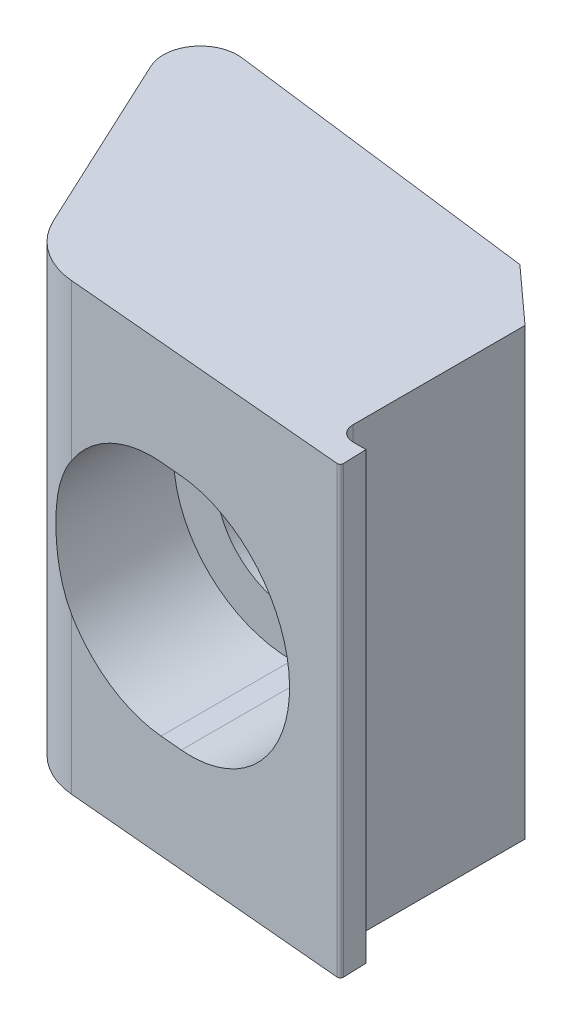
ISO-10303-21;
HEADER;
FILE_DESCRIPTION(('STEP AP214'),'2;1');
FILE_NAME('part.step','',(''),(''),'','','');
FILE_SCHEMA(('AUTOMOTIVE_DESIGN { 1 0 10303 214 1 1 1 1 }'));
ENDSEC;
DATA;
#1=APPLICATION_CONTEXT('core data for automotive mechanical design processes');
#2=APPLICATION_PROTOCOL_DEFINITION('international standard','automotive_design',2000,#1);
#3=PRODUCT_CONTEXT('',#1,'mechanical');
#4=PRODUCT('Part','Part','',(#3));
#5=PRODUCT_RELATED_PRODUCT_CATEGORY('part','',(#4));
#6=PRODUCT_DEFINITION_FORMATION('','',#4);
#7=PRODUCT_DEFINITION_CONTEXT('part definition',#1,'design');
#8=PRODUCT_DEFINITION('design','',#6,#7);
#9=PRODUCT_DEFINITION_SHAPE('','',#8);
#10=(LENGTH_UNIT() NAMED_UNIT(*) SI_UNIT(.MILLI.,.METRE.));
#11=(NAMED_UNIT(*) PLANE_ANGLE_UNIT() SI_UNIT($,.RADIAN.));
#12=(NAMED_UNIT(*) SI_UNIT($,.STERADIAN.) SOLID_ANGLE_UNIT());
#13=UNCERTAINTY_MEASURE_WITH_UNIT(LENGTH_MEASURE(1.E-05),#10,'distance_accuracy_value','');
#14=(GEOMETRIC_REPRESENTATION_CONTEXT(3) GLOBAL_UNCERTAINTY_ASSIGNED_CONTEXT((#13)) GLOBAL_UNIT_ASSIGNED_CONTEXT((#10,
#11,#12)) REPRESENTATION_CONTEXT('',''));
#15=CARTESIAN_POINT('',(0.,0.,0.));
#16=DIRECTION('',(0.,0.,1.));
#17=DIRECTION('',(1.,0.,0.));
#18=AXIS2_PLACEMENT_3D('',#15,#16,#17);
#19=CARTESIAN_POINT('',(7.6938110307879,19.05,3.45326209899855));
#20=DIRECTION('',(-0.671723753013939,0.,0.740801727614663));
#21=DIRECTION('',(0.740801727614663,0.,0.671723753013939));
#22=AXIS2_PLACEMENT_3D('',#19,#20,#21);
#23=PLANE('',#22);
#24=DIRECTION('',(-0.740801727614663,0.,-0.671723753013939));
#25=VECTOR('',#24,1.);
#26=CARTESIAN_POINT('',(7.6938110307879,-19.05,3.45326209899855));
#27=LINE('',#26,#25);
#28=CARTESIAN_POINT('',(12.4334510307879,-19.05,7.75094209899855));
#29=VERTEX_POINT('',#28);
#30=CARTESIAN_POINT('',(7.6938110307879,-19.05,3.45326209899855));
#31=VERTEX_POINT('',#30);
#32=EDGE_CURVE('E221',#29,#31,#27,.T.);
#33=ORIENTED_EDGE('',*,*,#32,.T.);
#34=DIRECTION('',(0.,-1.,0.));
#35=VECTOR('',#34,1.);
#36=CARTESIAN_POINT('',(7.6938110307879,19.05,3.45326209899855));
#37=LINE('',#36,#35);
#38=CARTESIAN_POINT('',(7.6938110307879,19.05,3.45326209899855));
#39=VERTEX_POINT('',#38);
#40=EDGE_CURVE('E296',#39,#31,#37,.T.);
#41=ORIENTED_EDGE('',*,*,#40,.F.);
#42=DIRECTION('',(-0.740801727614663,0.,-0.671723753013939));
#43=VECTOR('',#42,1.);
#44=CARTESIAN_POINT('',(7.6938110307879,19.05,3.45326209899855));
#45=LINE('',#44,#43);
#46=CARTESIAN_POINT('',(12.4334510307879,19.05,7.75094209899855));
#47=VERTEX_POINT('',#46);
#48=EDGE_CURVE('E324',#47,#39,#45,.T.);
#49=ORIENTED_EDGE('',*,*,#48,.F.);
#50=DIRECTION('',(0.,-1.,0.));
#51=VECTOR('',#50,1.);
#52=CARTESIAN_POINT('',(12.4334510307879,19.05,7.75094209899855));
#53=LINE('',#52,#51);
#54=EDGE_CURVE('E298',#47,#29,#53,.T.);
#55=ORIENTED_EDGE('',*,*,#54,.T.);
#56=EDGE_LOOP('',(#33,#41,#49,#55));
#57=FACE_BOUND('',#56,.T.);
#58=ADVANCED_FACE('F14',(#57),#23,.F.);
#59=CARTESIAN_POINT('',(-19.5552004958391,19.05,0.0248360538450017));
#60=DIRECTION('',(-0.124834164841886,0.,0.992177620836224));
#61=DIRECTION('',(0.992177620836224,0.,0.124834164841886));
#62=AXIS2_PLACEMENT_3D('',#59,#60,#61);
#63=PLANE('',#62);
#64=DIRECTION('',(0.992177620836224,0.,0.124834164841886));
#65=VECTOR('',#64,1.);
#66=CARTESIAN_POINT('',(-19.5552004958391,-6.5405,0.0248360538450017));
#67=LINE('',#66,#65);
#68=CARTESIAN_POINT('',(-1.905,-6.5405,2.245555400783));
#69=VERTEX_POINT('',#68);
#70=CARTESIAN_POINT('',(0.,-6.5405,2.48523938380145));
#71=VERTEX_POINT('',#70);
#72=EDGE_CURVE('E183',#69,#71,#67,.T.);
#73=ORIENTED_EDGE('',*,*,#72,.T.);
#74=CARTESIAN_POINT('',(0.,0.,2.48523938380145));
#75=DIRECTION('',(-0.124834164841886,0.,0.992177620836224));
#76=DIRECTION('',(0.992177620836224,0.,0.124834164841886));
#77=AXIS2_PLACEMENT_3D('',#74,#75,#76);
#78=ELLIPSE('',#77,6.59206563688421,6.5405);
#79=CARTESIAN_POINT('',(0.,6.5405,2.48523938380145));
#80=VERTEX_POINT('',#79);
#81=EDGE_CURVE('E186',#71,#80,#78,.T.);
#82=ORIENTED_EDGE('',*,*,#81,.T.);
#83=DIRECTION('',(-0.992177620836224,0.,-0.124834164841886));
#84=VECTOR('',#83,1.);
#85=CARTESIAN_POINT('',(-19.5552004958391,6.5405,0.0248360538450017));
#86=LINE('',#85,#84);
#87=CARTESIAN_POINT('',(-1.905,6.5405,2.245555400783));
#88=VERTEX_POINT('',#87);
#89=EDGE_CURVE('E178',#80,#88,#86,.T.);
#90=ORIENTED_EDGE('',*,*,#89,.T.);
#91=CARTESIAN_POINT('',(-1.905,0.,2.245555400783));
#92=DIRECTION('',(-0.124834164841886,0.,0.992177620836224));
#93=DIRECTION('',(0.992177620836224,0.,0.124834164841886));
#94=AXIS2_PLACEMENT_3D('',#91,#92,#93);
#95=ELLIPSE('',#94,6.59206563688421,6.5405);
#96=EDGE_CURVE('E158',#88,#69,#95,.T.);
#97=ORIENTED_EDGE('',*,*,#96,.T.);
#98=EDGE_LOOP('',(#73,#82,#90,#97));
#99=FACE_BOUND('',#98,.T.);
#100=DIRECTION('',(-0.992177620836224,0.,-0.124834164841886));
#101=VECTOR('',#100,1.);
#102=CARTESIAN_POINT('',(-19.5552004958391,-19.05,0.0248360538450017));
#103=LINE('',#102,#101);
#104=CARTESIAN_POINT('',(-19.5552004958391,-19.05,0.0248360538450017));
#105=VERTEX_POINT('',#104);
#106=EDGE_CURVE('E300',#31,#105,#103,.T.);
#107=ORIENTED_EDGE('',*,*,#106,.T.);
#108=DIRECTION('',(0.,-1.,0.));
#109=VECTOR('',#108,1.);
#110=CARTESIAN_POINT('',(-19.5552004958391,19.05,0.0248360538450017));
#111=LINE('',#110,#109);
#112=CARTESIAN_POINT('',(-19.5552004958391,19.05,0.0248360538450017));
#113=VERTEX_POINT('',#112);
#114=EDGE_CURVE('E373',#113,#105,#111,.T.);
#115=ORIENTED_EDGE('',*,*,#114,.F.);
#116=DIRECTION('',(-0.992177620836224,0.,-0.124834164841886));
#117=VECTOR('',#116,1.);
#118=CARTESIAN_POINT('',(-19.5552004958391,19.05,0.0248360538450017));
#119=LINE('',#118,#117);
#120=EDGE_CURVE('E327',#39,#113,#119,.T.);
#121=ORIENTED_EDGE('',*,*,#120,.F.);
#122=ORIENTED_EDGE('',*,*,#40,.T.);
#123=EDGE_LOOP('',(#107,#115,#121,#122));
#124=FACE_BOUND('',#123,.T.);
#125=ADVANCED_FACE('F282',(#99,#124),#63,.F.);
#126=CARTESIAN_POINT('',(-19.9515489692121,19.05,3.175));
#127=DIRECTION('',(0.,-1.,0.));
#128=DIRECTION('',(1.,0.,0.));
#129=AXIS2_PLACEMENT_3D('',#126,#127,#128);
#130=CYLINDRICAL_SURFACE('',#129,3.175);
#131=CARTESIAN_POINT('',(-19.9515489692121,-19.05,3.175));
#132=DIRECTION('',(0.,1.,0.));
#133=DIRECTION('',(-1.,0.,0.));
#134=AXIS2_PLACEMENT_3D('',#131,#132,#133);
#135=CIRCLE('',#134,3.175);
#136=CARTESIAN_POINT('',(-22.8291586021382,-19.05,4.5166362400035));
#137=VERTEX_POINT('',#136);
#138=EDGE_CURVE('E301',#105,#137,#135,.T.);
#139=ORIENTED_EDGE('',*,*,#138,.T.);
#140=DIRECTION('',(0.,-1.,0.));
#141=VECTOR('',#140,1.);
#142=CARTESIAN_POINT('',(-22.8291586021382,19.05,4.5166362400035));
#143=LINE('',#142,#141);
#144=CARTESIAN_POINT('',(-22.8291586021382,19.05,4.5166362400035));
#145=VERTEX_POINT('',#144);
#146=EDGE_CURVE('E370',#145,#137,#143,.T.);
#147=ORIENTED_EDGE('',*,*,#146,.F.);
#148=CARTESIAN_POINT('',(-19.9515489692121,19.05,3.175));
#149=DIRECTION('',(0.,1.,0.));
#150=DIRECTION('',(-1.,0.,0.));
#151=AXIS2_PLACEMENT_3D('',#148,#149,#150);
#152=CIRCLE('',#151,3.175);
#153=EDGE_CURVE('E329',#113,#145,#152,.T.);
#154=ORIENTED_EDGE('',*,*,#153,.F.);
#155=ORIENTED_EDGE('',*,*,#114,.T.);
#156=EDGE_LOOP('',(#139,#147,#154,#155));
#157=FACE_BOUND('',#156,.T.);
#158=ADVANCED_FACE('F288',(#157),#130,.T.);
#159=CARTESIAN_POINT('',(-15.5162882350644,19.05,20.2016524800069));
#160=DIRECTION('',(0.906333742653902,0.,-0.422562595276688));
#161=DIRECTION('',(-0.422562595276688,0.,-0.906333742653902));
#162=AXIS2_PLACEMENT_3D('',#159,#160,#161);
#163=PLANE('',#162);
#164=DIRECTION('',(0.422562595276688,0.,0.906333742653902));
#165=VECTOR('',#164,1.);
#166=CARTESIAN_POINT('',(-15.5162882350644,-19.05,20.2016524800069));
#167=LINE('',#166,#165);
#168=CARTESIAN_POINT('',(-15.5162882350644,-19.05,20.2016524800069));
#169=VERTEX_POINT('',#168);
#170=EDGE_CURVE('E305',#137,#169,#167,.T.);
#171=ORIENTED_EDGE('',*,*,#170,.T.);
#172=DIRECTION('',(0.,-1.,0.));
#173=VECTOR('',#172,1.);
#174=CARTESIAN_POINT('',(-15.5162882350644,19.05,20.2016524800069));
#175=LINE('',#174,#173);
#176=CARTESIAN_POINT('',(-15.5162882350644,19.05,20.2016524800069));
#177=VERTEX_POINT('',#176);
#178=EDGE_CURVE('E367',#177,#169,#175,.T.);
#179=ORIENTED_EDGE('',*,*,#178,.F.);
#180=DIRECTION('',(0.422562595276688,0.,0.906333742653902));
#181=VECTOR('',#180,1.);
#182=CARTESIAN_POINT('',(-15.5162882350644,19.05,20.2016524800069));
#183=LINE('',#182,#181);
#184=EDGE_CURVE('E331',#145,#177,#183,.T.);
#185=ORIENTED_EDGE('',*,*,#184,.F.);
#186=ORIENTED_EDGE('',*,*,#146,.T.);
#187=EDGE_LOOP('',(#171,#179,#185,#186));
#188=FACE_BOUND('',#187,.T.);
#189=ADVANCED_FACE('F278',(#188),#163,.F.);
#190=CARTESIAN_POINT('',(-9.7610689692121,19.05,17.51838));
#191=DIRECTION('',(0.,-1.,0.));
#192=DIRECTION('',(1.,0.,0.));
#193=AXIS2_PLACEMENT_3D('',#190,#191,#192);
#194=CYLINDRICAL_SURFACE('',#193,6.35);
#195=DIRECTION('',(0.,-1.,0.));
#196=VECTOR('',#195,1.);
#197=CARTESIAN_POINT('',(-10.3171636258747,19.05,23.8439834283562));
#198=LINE('',#197,#196);
#199=CARTESIAN_POINT('',(-10.3171636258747,-5.69746462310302,23.8439834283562));
#200=VERTEX_POINT('',#199);
#201=CARTESIAN_POINT('',(-10.3171636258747,-19.05,23.8439834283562));
#202=VERTEX_POINT('',#201);
#203=EDGE_CURVE('E363',#200,#202,#198,.T.);
#204=ORIENTED_EDGE('',*,*,#203,.F.);
#205=CARTESIAN_POINT('',(-10.3171636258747,-5.69746462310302,23.8439834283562));
#206=CARTESIAN_POINT('',(-10.4678141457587,-5.47505554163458,23.8306942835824));
#207=CARTESIAN_POINT('',(-10.6094437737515,-5.24692362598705,23.8128651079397));
#208=CARTESIAN_POINT('',(-10.8739933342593,-4.78063943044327,23.771536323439));
#209=CARTESIAN_POINT('',(-10.9969197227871,-4.54249064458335,23.7480386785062));
#210=CARTESIAN_POINT('',(-11.2238246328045,-4.05674728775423,23.6986980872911));
#211=CARTESIAN_POINT('',(-11.3277478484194,-3.80912760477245,23.6728486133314));
#212=CARTESIAN_POINT('',(-11.5157100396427,-3.30634011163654,23.6219223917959));
#213=CARTESIAN_POINT('',(-11.5997466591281,-3.0511714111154,23.5968457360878));
#214=CARTESIAN_POINT('',(-11.7515470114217,-2.5202256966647,23.5489021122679));
#215=CARTESIAN_POINT('',(-11.8181390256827,-2.24409386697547,23.5262369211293));
#216=CARTESIAN_POINT('',(-11.9280272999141,-1.68676764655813,23.4874836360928));
#217=CARTESIAN_POINT('',(-11.9713239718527,-1.40557334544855,23.471395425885));
#218=CARTESIAN_POINT('',(-12.0341310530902,-0.840756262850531,23.4476988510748));
#219=CARTESIAN_POINT('',(-12.0536900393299,-0.557139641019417,23.4400731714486));
#220=CARTESIAN_POINT('',(-12.0689645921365,0.0108230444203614,23.4341378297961));
#221=CARTESIAN_POINT('',(-12.0646815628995,0.295169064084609,23.4358276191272));
#222=CARTESIAN_POINT('',(-12.0330143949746,0.850229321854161,23.4480531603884));
#223=CARTESIAN_POINT('',(-12.0066198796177,1.12100927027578,23.458209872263));
#224=CARTESIAN_POINT('',(-11.9322827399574,1.6592208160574,23.4857827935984));
#225=CARTESIAN_POINT('',(-11.8843389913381,1.926652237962,23.5031993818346));
#226=CARTESIAN_POINT('',(-11.7672389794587,2.45674641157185,23.5434617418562));
#227=CARTESIAN_POINT('',(-11.6980572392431,2.71940303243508,23.5663140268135));
#228=CARTESIAN_POINT('',(-11.539029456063,3.23800433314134,23.6149573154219));
#229=CARTESIAN_POINT('',(-11.4491867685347,3.49395009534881,23.640747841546));
#230=CARTESIAN_POINT('',(-11.2132715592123,4.0887064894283,23.7016934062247));
#231=CARTESIAN_POINT('',(-11.0586004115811,4.42417188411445,23.7368766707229));
#232=CARTESIAN_POINT('',(-10.8000222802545,4.91305258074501,23.7834172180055));
#233=CARTESIAN_POINT('',(-10.7095447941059,5.07341407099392,23.7978759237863));
#234=CARTESIAN_POINT('',(-10.5198543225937,5.3892306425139,23.8236073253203));
#235=CARTESIAN_POINT('',(-10.4206379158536,5.54468376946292,23.83487876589));
#236=CARTESIAN_POINT('',(-10.3171636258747,5.69746462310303,23.8439834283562));
#237=B_SPLINE_CURVE_WITH_KNOTS('',3,(#205,#206,#207,#208,#209,#210,#211,#212,#213,#214,#215,
#216,#217,#218,#219,#220,#221,#222,#223,#224,#225,#226,#227,#228,#229,#230,#231,#232,#233,#234,
#235,#236),.UNSPECIFIED.,.F.,.F.,(4,2,2,2,2,2,2,2,2,2,2,2,2,2,2,4),(0.,0.806489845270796,
1.61270067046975,2.42122175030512,3.22983857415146,4.08364024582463,4.93742681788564,
5.78946323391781,6.64144946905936,7.45722302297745,8.27303914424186,9.08983776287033,
9.90650382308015,11.0172181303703,11.5710413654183,12.1250823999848),.UNSPECIFIED.);
#238=CARTESIAN_POINT('',(-10.3171636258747,5.69746462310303,23.8439834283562));
#239=VERTEX_POINT('',#238);
#240=EDGE_CURVE('E205',#200,#239,#237,.T.);
#241=ORIENTED_EDGE('',*,*,#240,.T.);
#242=CARTESIAN_POINT('',(-10.3171636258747,19.05,23.8439834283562));
#243=VERTEX_POINT('',#242);
#244=EDGE_CURVE('E364',#243,#239,#198,.T.);
#245=ORIENTED_EDGE('',*,*,#244,.F.);
#246=CARTESIAN_POINT('',(-9.7610689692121,19.05,17.51838));
#247=DIRECTION('',(0.,1.,0.));
#248=DIRECTION('',(-1.,0.,0.));
#249=AXIS2_PLACEMENT_3D('',#246,#247,#248);
#250=CIRCLE('',#249,6.35);
#251=EDGE_CURVE('E333',#177,#243,#250,.T.);
#252=ORIENTED_EDGE('',*,*,#251,.F.);
#253=ORIENTED_EDGE('',*,*,#178,.T.);
#254=CARTESIAN_POINT('',(-9.7610689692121,-19.05,17.51838));
#255=DIRECTION('',(0.,1.,0.));
#256=DIRECTION('',(-1.,0.,0.));
#257=AXIS2_PLACEMENT_3D('',#254,#255,#256);
#258=CIRCLE('',#257,6.35);
#259=EDGE_CURVE('E309',#169,#202,#258,.T.);
#260=ORIENTED_EDGE('',*,*,#259,.T.);
#261=EDGE_LOOP('',(#204,#241,#245,#252,#253,#260));
#262=FACE_BOUND('',#261,.T.);
#263=ADVANCED_FACE('F223',(#262),#194,.T.);
#264=CARTESIAN_POINT('',(14.6235472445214,19.05,26.0365641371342));
#265=DIRECTION('',(0.0875739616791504,0.,-0.99615802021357));
#266=DIRECTION('',(-0.99615802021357,0.,-0.0875739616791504));
#267=AXIS2_PLACEMENT_3D('',#264,#265,#266);
#268=PLANE('',#267);
#269=DIRECTION('',(-0.99615802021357,0.,-0.0875739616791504));
#270=VECTOR('',#269,1.);
#271=CARTESIAN_POINT('',(14.6235472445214,-10.16,26.0365641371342));
#272=LINE('',#271,#270);
#273=CARTESIAN_POINT('',(0.,-10.16,24.7509829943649));
#274=VERTEX_POINT('',#273);
#275=CARTESIAN_POINT('',(-1.905,-10.16,24.5835111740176));
#276=VERTEX_POINT('',#275);
#277=EDGE_CURVE('E17',#274,#276,#272,.T.);
#278=ORIENTED_EDGE('',*,*,#277,.T.);
#279=CARTESIAN_POINT('',(-1.905,0.,24.5835111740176));
#280=DIRECTION('',(0.0875739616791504,0.,-0.99615802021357));
#281=DIRECTION('',(0.99615802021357,0.,0.0875739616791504));
#282=AXIS2_PLACEMENT_3D('',#279,#280,#281);
#283=ELLIPSE('',#282,10.1991850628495,10.16);
#284=EDGE_CURVE('E9',#276,#200,#283,.T.);
#285=ORIENTED_EDGE('',*,*,#284,.T.);
#286=ORIENTED_EDGE('',*,*,#203,.T.);
#287=DIRECTION('',(0.99615802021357,0.,0.0875739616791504));
#288=VECTOR('',#287,1.);
#289=CARTESIAN_POINT('',(14.6235472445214,-19.05,26.0365641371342));
#290=LINE('',#289,#288);
#291=CARTESIAN_POINT('',(14.6235472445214,-19.05,26.0365641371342));
#292=VERTEX_POINT('',#291);
#293=EDGE_CURVE('E312',#202,#292,#290,.T.);
#294=ORIENTED_EDGE('',*,*,#293,.T.);
#295=DIRECTION('',(0.,-1.,0.));
#296=VECTOR('',#295,1.);
#297=CARTESIAN_POINT('',(14.6235472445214,19.05,26.0365641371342));
#298=LINE('',#297,#296);
#299=CARTESIAN_POINT('',(14.6235472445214,19.05,26.0365641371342));
#300=VERTEX_POINT('',#299);
#301=EDGE_CURVE('E360',#300,#292,#298,.T.);
#302=ORIENTED_EDGE('',*,*,#301,.F.);
#303=DIRECTION('',(0.99615802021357,0.,0.0875739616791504));
#304=VECTOR('',#303,1.);
#305=CARTESIAN_POINT('',(14.6235472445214,19.05,26.0365641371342));
#306=LINE('',#305,#304);
#307=EDGE_CURVE('E335',#243,#300,#306,.T.);
#308=ORIENTED_EDGE('',*,*,#307,.F.);
#309=ORIENTED_EDGE('',*,*,#244,.T.);
#310=CARTESIAN_POINT('',(-1.905,10.16,24.5835111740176));
#311=VERTEX_POINT('',#310);
#312=EDGE_CURVE('E23',#239,#311,#283,.T.);
#313=ORIENTED_EDGE('',*,*,#312,.T.);
#314=DIRECTION('',(0.99615802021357,0.,0.0875739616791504));
#315=VECTOR('',#314,1.);
#316=CARTESIAN_POINT('',(14.6235472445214,10.16,26.0365641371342));
#317=LINE('',#316,#315);
#318=CARTESIAN_POINT('',(0.,10.16,24.7509829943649));
#319=VERTEX_POINT('',#318);
#320=EDGE_CURVE('E376',#311,#319,#317,.T.);
#321=ORIENTED_EDGE('',*,*,#320,.T.);
#322=CARTESIAN_POINT('',(0.,0.,24.7509829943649));
#323=DIRECTION('',(0.0875739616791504,0.,-0.99615802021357));
#324=DIRECTION('',(0.99615802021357,0.,0.0875739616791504));
#325=AXIS2_PLACEMENT_3D('',#322,#323,#324);
#326=ELLIPSE('',#325,10.1991850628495,10.16);
#327=EDGE_CURVE('E379',#319,#274,#326,.T.);
#328=ORIENTED_EDGE('',*,*,#327,.T.);
#329=EDGE_LOOP('',(#278,#285,#286,#294,#302,#308,#309,#313,#321,#328));
#330=FACE_BOUND('',#329,.T.);
#331=ADVANCED_FACE('F269',(#330),#268,.F.);
#332=CARTESIAN_POINT('',(14.6457910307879,19.05,25.78354));
#333=DIRECTION('',(0.,-1.,0.));
#334=DIRECTION('',(1.,0.,0.));
#335=AXIS2_PLACEMENT_3D('',#332,#333,#334);
#336=CYLINDRICAL_SURFACE('',#335,0.254);
#337=CARTESIAN_POINT('',(14.6457910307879,-19.05,25.78354));
#338=DIRECTION('',(0.,1.,0.));
#339=DIRECTION('',(-1.,0.,0.));
#340=AXIS2_PLACEMENT_3D('',#337,#338,#339);
#341=CIRCLE('',#340,0.254);
#342=CARTESIAN_POINT('',(14.89964,-19.05,25.7747820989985));
#343=VERTEX_POINT('',#342);
#344=EDGE_CURVE('E314',#292,#343,#341,.T.);
#345=ORIENTED_EDGE('',*,*,#344,.T.);
#346=DIRECTION('',(0.,-1.,0.));
#347=VECTOR('',#346,1.);
#348=CARTESIAN_POINT('',(14.89964,19.05,25.7747820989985));
#349=LINE('',#348,#347);
#350=CARTESIAN_POINT('',(14.89964,19.05,25.7747820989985));
#351=VERTEX_POINT('',#350);
#352=EDGE_CURVE('E357',#351,#343,#349,.T.);
#353=ORIENTED_EDGE('',*,*,#352,.F.);
#354=CARTESIAN_POINT('',(14.6457910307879,19.05,25.78354));
#355=DIRECTION('',(0.,1.,0.));
#356=DIRECTION('',(-1.,0.,0.));
#357=AXIS2_PLACEMENT_3D('',#354,#355,#356);
#358=CIRCLE('',#357,0.254);
#359=EDGE_CURVE('E337',#300,#351,#358,.T.);
#360=ORIENTED_EDGE('',*,*,#359,.F.);
#361=ORIENTED_EDGE('',*,*,#301,.T.);
#362=EDGE_LOOP('',(#345,#353,#360,#361));
#363=FACE_BOUND('',#362,.T.);
#364=ADVANCED_FACE('F266',(#363),#336,.T.);
#365=CARTESIAN_POINT('',(14.89964,19.05,25.7747820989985));
#366=DIRECTION('',(-0.999405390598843,0.,0.0344799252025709));
#367=DIRECTION('',(0.0344799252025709,0.,0.999405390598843));
#368=AXIS2_PLACEMENT_3D('',#365,#366,#367);
#369=PLANE('',#368);
#370=DIRECTION('',(-0.0344799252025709,0.,-0.999405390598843));
#371=VECTOR('',#370,1.);
#372=CARTESIAN_POINT('',(14.89964,-19.05,25.7747820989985));
#373=LINE('',#372,#371);
#374=CARTESIAN_POINT('',(14.8303630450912,-19.05,23.76678));
#375=VERTEX_POINT('',#374);
#376=EDGE_CURVE('E316',#343,#375,#373,.T.);
#377=ORIENTED_EDGE('',*,*,#376,.T.);
#378=DIRECTION('',(0.,-1.,0.));
#379=VECTOR('',#378,1.);
#380=CARTESIAN_POINT('',(14.8303630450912,19.05,23.76678));
#381=LINE('',#380,#379);
#382=CARTESIAN_POINT('',(14.8303630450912,19.05,23.76678));
#383=VERTEX_POINT('',#382);
#384=EDGE_CURVE('E354',#383,#375,#381,.T.);
#385=ORIENTED_EDGE('',*,*,#384,.F.);
#386=DIRECTION('',(-0.0344799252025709,0.,-0.999405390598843));
#387=VECTOR('',#386,1.);
#388=CARTESIAN_POINT('',(14.89964,19.05,25.7747820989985));
#389=LINE('',#388,#387);
#390=EDGE_CURVE('E339',#351,#383,#389,.T.);
#391=ORIENTED_EDGE('',*,*,#390,.F.);
#392=ORIENTED_EDGE('',*,*,#352,.T.);
#393=EDGE_LOOP('',(#377,#385,#391,#392));
#394=FACE_BOUND('',#393,.T.);
#395=ADVANCED_FACE('F262',(#394),#369,.F.);
#396=CARTESIAN_POINT('',(13.7034510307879,19.05,23.76678));
#397=DIRECTION('',(0.,0.,1.));
#398=DIRECTION('',(0.,1.,0.));
#399=AXIS2_PLACEMENT_3D('',#396,#397,#398);
#400=PLANE('',#399);
#401=DIRECTION('',(-1.,0.,0.));
#402=VECTOR('',#401,1.);
#403=CARTESIAN_POINT('',(13.7034510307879,-19.05,23.76678));
#404=LINE('',#403,#402);
#405=CARTESIAN_POINT('',(13.7034510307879,-19.05,23.76678));
#406=VERTEX_POINT('',#405);
#407=EDGE_CURVE('E318',#375,#406,#404,.T.);
#408=ORIENTED_EDGE('',*,*,#407,.T.);
#409=DIRECTION('',(0.,-1.,0.));
#410=VECTOR('',#409,1.);
#411=CARTESIAN_POINT('',(13.7034510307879,19.05,23.76678));
#412=LINE('',#411,#410);
#413=CARTESIAN_POINT('',(13.7034510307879,19.05,23.76678));
#414=VERTEX_POINT('',#413);
#415=EDGE_CURVE('E351',#414,#406,#412,.T.);
#416=ORIENTED_EDGE('',*,*,#415,.F.);
#417=DIRECTION('',(-1.,0.,0.));
#418=VECTOR('',#417,1.);
#419=CARTESIAN_POINT('',(13.7034510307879,19.05,23.76678));
#420=LINE('',#419,#418);
#421=EDGE_CURVE('E341',#383,#414,#420,.T.);
#422=ORIENTED_EDGE('',*,*,#421,.F.);
#423=ORIENTED_EDGE('',*,*,#384,.T.);
#424=EDGE_LOOP('',(#408,#416,#422,#423));
#425=FACE_BOUND('',#424,.T.);
#426=ADVANCED_FACE('F258',(#425),#400,.F.);
#427=CARTESIAN_POINT('',(13.7034510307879,19.05,22.49678));
#428=DIRECTION('',(0.,-1.,0.));
#429=DIRECTION('',(1.,0.,0.));
#430=AXIS2_PLACEMENT_3D('',#427,#428,#429);
#431=CYLINDRICAL_SURFACE('',#430,1.27);
#432=CARTESIAN_POINT('',(13.7034510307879,-19.05,22.49678));
#433=DIRECTION('',(0.,-1.,0.));
#434=DIRECTION('',(-1.,0.,0.));
#435=AXIS2_PLACEMENT_3D('',#432,#433,#434);
#436=CIRCLE('',#435,1.27);
#437=CARTESIAN_POINT('',(12.4334510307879,-19.05,22.49678));
#438=VERTEX_POINT('',#437);
#439=EDGE_CURVE('E320',#406,#438,#436,.T.);
#440=ORIENTED_EDGE('',*,*,#439,.T.);
#441=DIRECTION('',(0.,-1.,0.));
#442=VECTOR('',#441,1.);
#443=CARTESIAN_POINT('',(12.4334510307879,19.05,22.49678));
#444=LINE('',#443,#442);
#445=CARTESIAN_POINT('',(12.4334510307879,19.05,22.49678));
#446=VERTEX_POINT('',#445);
#447=EDGE_CURVE('E348',#446,#438,#444,.T.);
#448=ORIENTED_EDGE('',*,*,#447,.F.);
#449=CARTESIAN_POINT('',(13.7034510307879,19.05,22.49678));
#450=DIRECTION('',(0.,-1.,0.));
#451=DIRECTION('',(-1.,0.,0.));
#452=AXIS2_PLACEMENT_3D('',#449,#450,#451);
#453=CIRCLE('',#452,1.27);
#454=EDGE_CURVE('E343',#414,#446,#453,.T.);
#455=ORIENTED_EDGE('',*,*,#454,.F.);
#456=ORIENTED_EDGE('',*,*,#415,.T.);
#457=EDGE_LOOP('',(#440,#448,#455,#456));
#458=FACE_BOUND('',#457,.T.);
#459=ADVANCED_FACE('F254',(#458),#431,.F.);
#460=CARTESIAN_POINT('',(12.4334510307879,19.05,22.49678));
#461=DIRECTION('',(-1.,0.,0.));
#462=DIRECTION('',(0.,0.,1.));
#463=AXIS2_PLACEMENT_3D('',#460,#461,#462);
#464=PLANE('',#463);
#465=DIRECTION('',(0.,0.,-1.));
#466=VECTOR('',#465,1.);
#467=CARTESIAN_POINT('',(12.4334510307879,-19.05,22.49678));
#468=LINE('',#467,#466);
#469=EDGE_CURVE('E322',#438,#29,#468,.T.);
#470=ORIENTED_EDGE('',*,*,#469,.T.);
#471=ORIENTED_EDGE('',*,*,#54,.F.);
#472=DIRECTION('',(0.,0.,-1.));
#473=VECTOR('',#472,1.);
#474=CARTESIAN_POINT('',(12.4334510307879,19.05,22.49678));
#475=LINE('',#474,#473);
#476=EDGE_CURVE('E345',#446,#47,#475,.T.);
#477=ORIENTED_EDGE('',*,*,#476,.F.);
#478=ORIENTED_EDGE('',*,*,#447,.T.);
#479=EDGE_LOOP('',(#470,#471,#477,#478));
#480=FACE_BOUND('',#479,.T.);
#481=ADVANCED_FACE('F250',(#480),#464,.F.);
#482=CARTESIAN_POINT('',(13.7034510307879,19.05,22.49678));
#483=DIRECTION('',(0.,1.,0.));
#484=DIRECTION('',(-1.,0.,0.));
#485=AXIS2_PLACEMENT_3D('',#482,#483,#484);
#486=PLANE('',#485);
#487=ORIENTED_EDGE('',*,*,#48,.T.);
#488=ORIENTED_EDGE('',*,*,#120,.T.);
#489=ORIENTED_EDGE('',*,*,#153,.T.);
#490=ORIENTED_EDGE('',*,*,#184,.T.);
#491=ORIENTED_EDGE('',*,*,#251,.T.);
#492=ORIENTED_EDGE('',*,*,#307,.T.);
#493=ORIENTED_EDGE('',*,*,#359,.T.);
#494=ORIENTED_EDGE('',*,*,#390,.T.);
#495=ORIENTED_EDGE('',*,*,#421,.T.);
#496=ORIENTED_EDGE('',*,*,#454,.T.);
#497=ORIENTED_EDGE('',*,*,#476,.T.);
#498=EDGE_LOOP('',(#487,#488,#489,#490,#491,#492,#493,#494,#495,#496,#497));
#499=FACE_BOUND('',#498,.T.);
#500=ADVANCED_FACE('F246',(#499),#486,.T.);
#501=CARTESIAN_POINT('',(13.7034510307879,-19.05,22.49678));
#502=DIRECTION('',(0.,1.,0.));
#503=DIRECTION('',(-1.,0.,0.));
#504=AXIS2_PLACEMENT_3D('',#501,#502,#503);
#505=PLANE('',#504);
#506=ORIENTED_EDGE('',*,*,#32,.F.);
#507=ORIENTED_EDGE('',*,*,#469,.F.);
#508=ORIENTED_EDGE('',*,*,#439,.F.);
#509=ORIENTED_EDGE('',*,*,#407,.F.);
#510=ORIENTED_EDGE('',*,*,#376,.F.);
#511=ORIENTED_EDGE('',*,*,#344,.F.);
#512=ORIENTED_EDGE('',*,*,#293,.F.);
#513=ORIENTED_EDGE('',*,*,#259,.F.);
#514=ORIENTED_EDGE('',*,*,#170,.F.);
#515=ORIENTED_EDGE('',*,*,#138,.F.);
#516=ORIENTED_EDGE('',*,*,#106,.F.);
#517=EDGE_LOOP('',(#506,#507,#508,#509,#510,#511,#512,#513,#514,#515,#516));
#518=FACE_BOUND('',#517,.T.);
#519=ADVANCED_FACE('F242',(#518),#505,.F.);
#520=CARTESIAN_POINT('',(0.,0.,13.3604));
#521=DIRECTION('',(0.,0.,1.));
#522=DIRECTION('',(0.,1.,0.));
#523=AXIS2_PLACEMENT_3D('',#520,#521,#522);
#524=CYLINDRICAL_SURFACE('',#523,10.16);
#525=DIRECTION('',(0.,0.,1.));
#526=VECTOR('',#525,1.);
#527=CARTESIAN_POINT('',(0.,10.16,13.3604));
#528=LINE('',#527,#526);
#529=CARTESIAN_POINT('',(0.,10.16,13.3604));
#530=VERTEX_POINT('',#529);
#531=EDGE_CURVE('E201',#530,#319,#528,.T.);
#532=ORIENTED_EDGE('',*,*,#531,.F.);
#533=CARTESIAN_POINT('',(0.,0.,13.3604));
#534=DIRECTION('',(0.,0.,1.));
#535=DIRECTION('',(0.,1.,0.));
#536=AXIS2_PLACEMENT_3D('',#533,#534,#535);
#537=CIRCLE('',#536,10.16);
#538=CARTESIAN_POINT('',(0.,-10.16,13.3604));
#539=VERTEX_POINT('',#538);
#540=EDGE_CURVE('E189',#539,#530,#537,.T.);
#541=ORIENTED_EDGE('',*,*,#540,.F.);
#542=DIRECTION('',(0.,0.,1.));
#543=VECTOR('',#542,1.);
#544=CARTESIAN_POINT('',(0.,-10.16,13.3604));
#545=LINE('',#544,#543);
#546=EDGE_CURVE('E202',#539,#274,#545,.T.);
#547=ORIENTED_EDGE('',*,*,#546,.T.);
#548=ORIENTED_EDGE('',*,*,#327,.F.);
#549=EDGE_LOOP('',(#532,#541,#547,#548));
#550=FACE_BOUND('',#549,.T.);
#551=ADVANCED_FACE('F239',(#550),#524,.F.);
#552=CARTESIAN_POINT('',(0.,-10.16,13.3604));
#553=DIRECTION('',(0.,-1.,0.));
#554=DIRECTION('',(1.,0.,0.));
#555=AXIS2_PLACEMENT_3D('',#552,#553,#554);
#556=PLANE('',#555);
#557=ORIENTED_EDGE('',*,*,#546,.F.);
#558=DIRECTION('',(1.,0.,0.));
#559=VECTOR('',#558,1.);
#560=CARTESIAN_POINT('',(0.,-10.16,13.3604));
#561=LINE('',#560,#559);
#562=CARTESIAN_POINT('',(-1.905,-10.16,13.3604));
#563=VERTEX_POINT('',#562);
#564=EDGE_CURVE('E198',#563,#539,#561,.T.);
#565=ORIENTED_EDGE('',*,*,#564,.F.);
#566=DIRECTION('',(0.,0.,1.));
#567=VECTOR('',#566,1.);
#568=CARTESIAN_POINT('',(-1.905,-10.16,13.3604));
#569=LINE('',#568,#567);
#570=EDGE_CURVE('E206',#563,#276,#569,.T.);
#571=ORIENTED_EDGE('',*,*,#570,.T.);
#572=ORIENTED_EDGE('',*,*,#277,.F.);
#573=EDGE_LOOP('',(#557,#565,#571,#572));
#574=FACE_BOUND('',#573,.T.);
#575=ADVANCED_FACE('F233',(#574),#556,.F.);
#576=CARTESIAN_POINT('',(-1.905,0.,13.3604));
#577=DIRECTION('',(0.,0.,1.));
#578=DIRECTION('',(0.,1.,0.));
#579=AXIS2_PLACEMENT_3D('',#576,#577,#578);
#580=CYLINDRICAL_SURFACE('',#579,10.16);
#581=ORIENTED_EDGE('',*,*,#570,.F.);
#582=CARTESIAN_POINT('',(-1.905,0.,13.3604));
#583=DIRECTION('',(0.,0.,1.));
#584=DIRECTION('',(0.,1.,0.));
#585=AXIS2_PLACEMENT_3D('',#582,#583,#584);
#586=CIRCLE('',#585,10.16);
#587=CARTESIAN_POINT('',(-1.905,10.16,13.3604));
#588=VERTEX_POINT('',#587);
#589=EDGE_CURVE('E195',#588,#563,#586,.T.);
#590=ORIENTED_EDGE('',*,*,#589,.F.);
#591=DIRECTION('',(0.,0.,1.));
#592=VECTOR('',#591,1.);
#593=CARTESIAN_POINT('',(-1.905,10.16,13.3604));
#594=LINE('',#593,#592);
#595=EDGE_CURVE('E209',#588,#311,#594,.T.);
#596=ORIENTED_EDGE('',*,*,#595,.T.);
#597=ORIENTED_EDGE('',*,*,#312,.F.);
#598=ORIENTED_EDGE('',*,*,#240,.F.);
#599=ORIENTED_EDGE('',*,*,#284,.F.);
#600=EDGE_LOOP('',(#581,#590,#596,#597,#598,#599));
#601=FACE_BOUND('',#600,.T.);
#602=ADVANCED_FACE('F227',(#601),#580,.F.);
#603=CARTESIAN_POINT('',(-1.905,10.16,13.3604));
#604=DIRECTION('',(0.,1.,0.));
#605=DIRECTION('',(-1.,0.,0.));
#606=AXIS2_PLACEMENT_3D('',#603,#604,#605);
#607=PLANE('',#606);
#608=ORIENTED_EDGE('',*,*,#595,.F.);
#609=DIRECTION('',(-1.,0.,0.));
#610=VECTOR('',#609,1.);
#611=CARTESIAN_POINT('',(-1.905,10.16,13.3604));
#612=LINE('',#611,#610);
#613=EDGE_CURVE('E192',#530,#588,#612,.T.);
#614=ORIENTED_EDGE('',*,*,#613,.F.);
#615=ORIENTED_EDGE('',*,*,#531,.T.);
#616=ORIENTED_EDGE('',*,*,#320,.F.);
#617=EDGE_LOOP('',(#608,#614,#615,#616));
#618=FACE_BOUND('',#617,.T.);
#619=ADVANCED_FACE('F232',(#618),#607,.F.);
#620=CARTESIAN_POINT('',(0.,0.,13.3604));
#621=DIRECTION('',(0.,0.,1.));
#622=DIRECTION('',(0.,1.,0.));
#623=AXIS2_PLACEMENT_3D('',#620,#621,#622);
#624=PLANE('',#623);
#625=CARTESIAN_POINT('',(0.,0.,13.3604));
#626=DIRECTION('',(0.,0.,1.));
#627=DIRECTION('',(0.,1.,0.));
#628=AXIS2_PLACEMENT_3D('',#625,#626,#627);
#629=CIRCLE('',#628,6.5405);
#630=CARTESIAN_POINT('',(0.,-6.5405,13.3604));
#631=VERTEX_POINT('',#630);
#632=CARTESIAN_POINT('',(0.,6.5405,13.3604));
#633=VERTEX_POINT('',#632);
#634=EDGE_CURVE('E38',#631,#633,#629,.T.);
#635=ORIENTED_EDGE('',*,*,#634,.F.);
#636=DIRECTION('',(1.,0.,0.));
#637=VECTOR('',#636,1.);
#638=CARTESIAN_POINT('',(-1.905,-6.5405,13.3604));
#639=LINE('',#638,#637);
#640=CARTESIAN_POINT('',(-1.905,-6.5405,13.3604));
#641=VERTEX_POINT('',#640);
#642=EDGE_CURVE('E171',#641,#631,#639,.T.);
#643=ORIENTED_EDGE('',*,*,#642,.F.);
#644=CARTESIAN_POINT('',(-1.905,0.,13.3604));
#645=DIRECTION('',(0.,0.,1.));
#646=DIRECTION('',(0.,1.,0.));
#647=AXIS2_PLACEMENT_3D('',#644,#645,#646);
#648=CIRCLE('',#647,6.5405);
#649=CARTESIAN_POINT('',(-1.905,6.5405,13.3604));
#650=VERTEX_POINT('',#649);
#651=EDGE_CURVE('E155',#650,#641,#648,.T.);
#652=ORIENTED_EDGE('',*,*,#651,.F.);
#653=DIRECTION('',(-1.,0.,0.));
#654=VECTOR('',#653,1.);
#655=CARTESIAN_POINT('',(-1.905,6.5405,13.3604));
#656=LINE('',#655,#654);
#657=EDGE_CURVE('E164',#633,#650,#656,.T.);
#658=ORIENTED_EDGE('',*,*,#657,.F.);
#659=EDGE_LOOP('',(#635,#643,#652,#658));
#660=FACE_BOUND('',#659,.T.);
#661=ORIENTED_EDGE('',*,*,#540,.T.);
#662=ORIENTED_EDGE('',*,*,#613,.T.);
#663=ORIENTED_EDGE('',*,*,#589,.T.);
#664=ORIENTED_EDGE('',*,*,#564,.T.);
#665=EDGE_LOOP('',(#661,#662,#663,#664));
#666=FACE_BOUND('',#665,.T.);
#667=ADVANCED_FACE('F168',(#660,#666),#624,.T.);
#668=CARTESIAN_POINT('',(0.,0.,0.));
#669=DIRECTION('',(0.,0.,1.));
#670=DIRECTION('',(0.,1.,0.));
#671=AXIS2_PLACEMENT_3D('',#668,#669,#670);
#672=CYLINDRICAL_SURFACE('',#671,6.5405);
#673=DIRECTION('',(0.,0.,1.));
#674=VECTOR('',#673,1.);
#675=CARTESIAN_POINT('',(0.,-6.5405,0.));
#676=LINE('',#675,#674);
#677=EDGE_CURVE('E176',#71,#631,#676,.T.);
#678=ORIENTED_EDGE('',*,*,#677,.T.);
#679=ORIENTED_EDGE('',*,*,#634,.T.);
#680=DIRECTION('',(0.,0.,1.));
#681=VECTOR('',#680,1.);
#682=CARTESIAN_POINT('',(0.,6.5405,0.));
#683=LINE('',#682,#681);
#684=EDGE_CURVE('E161',#80,#633,#683,.T.);
#685=ORIENTED_EDGE('',*,*,#684,.F.);
#686=ORIENTED_EDGE('',*,*,#81,.F.);
#687=EDGE_LOOP('',(#678,#679,#685,#686));
#688=FACE_BOUND('',#687,.T.);
#689=ADVANCED_FACE('F502',(#688),#672,.F.);
#690=CARTESIAN_POINT('',(-1.905,-6.5405,0.));
#691=DIRECTION('',(0.,-1.,0.));
#692=DIRECTION('',(1.,0.,0.));
#693=AXIS2_PLACEMENT_3D('',#690,#691,#692);
#694=PLANE('',#693);
#695=DIRECTION('',(0.,0.,1.));
#696=VECTOR('',#695,1.);
#697=CARTESIAN_POINT('',(-1.905,-6.5405,0.));
#698=LINE('',#697,#696);
#699=EDGE_CURVE('E160',#69,#641,#698,.T.);
#700=ORIENTED_EDGE('',*,*,#699,.T.);
#701=ORIENTED_EDGE('',*,*,#642,.T.);
#702=ORIENTED_EDGE('',*,*,#677,.F.);
#703=ORIENTED_EDGE('',*,*,#72,.F.);
#704=EDGE_LOOP('',(#700,#701,#702,#703));
#705=FACE_BOUND('',#704,.T.);
#706=ADVANCED_FACE('F508',(#705),#694,.F.);
#707=CARTESIAN_POINT('',(-1.905,0.,0.));
#708=DIRECTION('',(0.,0.,1.));
#709=DIRECTION('',(0.,1.,0.));
#710=AXIS2_PLACEMENT_3D('',#707,#708,#709);
#711=CYLINDRICAL_SURFACE('',#710,6.5405);
#712=DIRECTION('',(0.,0.,1.));
#713=VECTOR('',#712,1.);
#714=CARTESIAN_POINT('',(-1.905,6.5405,0.));
#715=LINE('',#714,#713);
#716=EDGE_CURVE('E30',#88,#650,#715,.T.);
#717=ORIENTED_EDGE('',*,*,#716,.T.);
#718=ORIENTED_EDGE('',*,*,#651,.T.);
#719=ORIENTED_EDGE('',*,*,#699,.F.);
#720=ORIENTED_EDGE('',*,*,#96,.F.);
#721=EDGE_LOOP('',(#717,#718,#719,#720));
#722=FACE_BOUND('',#721,.T.);
#723=ADVANCED_FACE('F152',(#722),#711,.F.);
#724=CARTESIAN_POINT('',(-1.905,6.5405,0.));
#725=DIRECTION('',(0.,1.,0.));
#726=DIRECTION('',(-1.,0.,0.));
#727=AXIS2_PLACEMENT_3D('',#724,#725,#726);
#728=PLANE('',#727);
#729=ORIENTED_EDGE('',*,*,#684,.T.);
#730=ORIENTED_EDGE('',*,*,#657,.T.);
#731=ORIENTED_EDGE('',*,*,#716,.F.);
#732=ORIENTED_EDGE('',*,*,#89,.F.);
#733=EDGE_LOOP('',(#729,#730,#731,#732));
#734=FACE_BOUND('',#733,.T.);
#735=ADVANCED_FACE('F165',(#734),#728,.F.);
#736=CLOSED_SHELL('',(#58,#125,#158,#189,#263,#331,#364,#395,#426,#459,#481,#500,#519,#551,#575,
#602,#619,#667,#689,#706,#723,#735));
#737=MANIFOLD_SOLID_BREP('B1',#736);
#738=ADVANCED_BREP_SHAPE_REPRESENTATION('',(#18,#737),#14);
#739=SHAPE_DEFINITION_REPRESENTATION(#9,#738);
ENDSEC;
END-ISO-10303-21;
